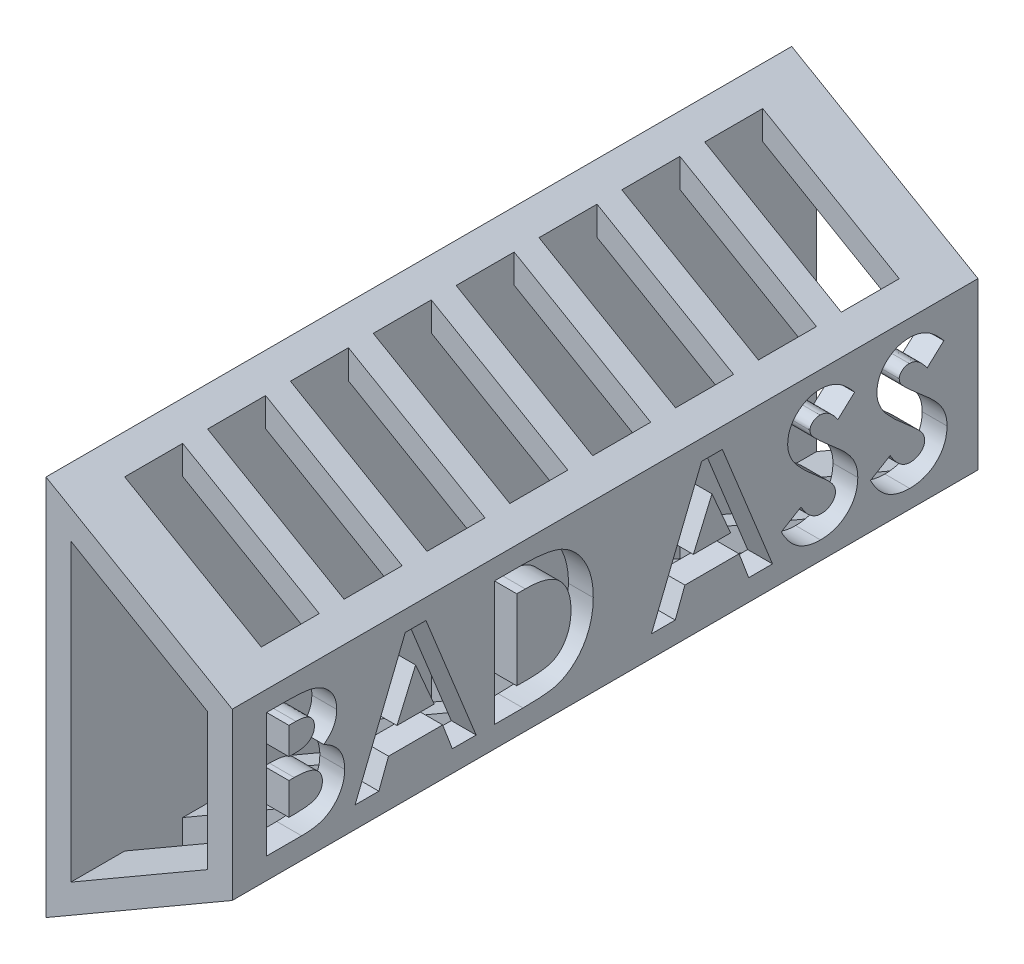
from build123d import *

# Parameters (mm, degrees)
BOSS_EXTRUDE1_DEPTH     = 457.2
CUT_EXTRUDE1_DEPTH      = 512.738034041
CUT_EXTRUDE1_DEPTH_BACK = 512.738034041
SKETCH2_W               = 83.713809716
SKETCH2_H               = 35.56
CUT_EXTRUDE2_DEPTH      = 15.24


with BuildPart() as part:
    # Sketch1 → Boss-Extrude1 (new body)
    with BuildSketch(Plane.XY):
        Polygon((-15.24, -26.443954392), (-15.24, 207.490045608), (98.953809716, 141.323045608), (98.953809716, 39.723045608), align=None)
        Polygon((0, 0), (0, 181.046091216), (83.713809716, 132.540032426), (83.713809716, 48.50605879), align=None, mode=Mode.SUBTRACT)
    extrude(amount=-BOSS_EXTRUDE1_DEPTH)

    # Sketch2 → Cut-Extrude1 (cut, two sides: drawn at the far end of the back side and taken through both)
    with BuildSketch(Plane(origin=(0, 0, 0), x_dir=(1, 0, 0), z_dir=(0, 1, 0)).offset(-CUT_EXTRUDE1_DEPTH_BACK)):
        with Locations((41.856904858, 406.4)):
            Rectangle(SKETCH2_W, SKETCH2_H)
        with Locations((41.856904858, 355.6)):
            Rectangle(SKETCH2_W, SKETCH2_H)
        with Locations((41.856904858, 101.6)):
            Rectangle(SKETCH2_W, SKETCH2_H)
        with Locations((41.856904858, 304.8)):
            Rectangle(SKETCH2_W, SKETCH2_H)
        with Locations((41.856904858, 254)):
            Rectangle(SKETCH2_W, SKETCH2_H)
        with Locations((41.856904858, 203.2)):
            Rectangle(SKETCH2_W, SKETCH2_H)
        with Locations((41.856904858, 50.8)):
            Rectangle(SKETCH2_W, SKETCH2_H)
        with Locations((41.856904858, 152.4)):
            Rectangle(SKETCH2_W, SKETCH2_H)
    extrude(amount=CUT_EXTRUDE1_DEPTH + CUT_EXTRUDE1_DEPTH_BACK, mode=Mode.SUBTRACT)

    # Sketch3 → Cut-Extrude2 (cut)
    # profile 1 of 6: a face of its own
    with BuildSketch(Plane(origin=(98.953809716, 0, 0), x_dir=(0, 0, -1), z_dir=(1, 0, 0))):
        with BuildLine():
            Line((21.060355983, 52.815741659), (21.060355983, 129.015741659))
            Line((21.060355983, 129.015741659), (33.271894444, 129.015741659))
            add(Edge.make_bspline(
                [(33.271894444, 129.015741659), (34.126778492, 129.015839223), (35.780962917, 129.016028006), (38.167519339, 128.93221998), (40.38084887, 128.823804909), (42.413907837, 128.702513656), (44.270156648, 128.493504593), (45.946772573, 128.273231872), (47.447105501, 128.007596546), (48.374679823, 127.769313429), (48.811077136, 127.657208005)],
                knots=[0, 0, 0, 0, 1.311965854, 2.538629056, 3.664479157, 4.713267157, 5.663616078, 6.530575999, 7.308677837, 8, 8, 8, 8], degree=3))
            add(Edge.make_bspline(
                [(48.811077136, 127.657208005), (49.384111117, 127.499081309), (50.508587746, 127.188785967), (52.119197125, 126.562131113), (53.647084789, 125.865559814), (55.090385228, 125.070902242), (56.440236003, 124.168564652), (57.691507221, 123.151385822), (58.871185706, 122.060195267), (59.937383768, 120.864581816), (60.901051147, 119.60119473), (61.738305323, 118.27036505), (62.46577189, 116.892442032), (63.047935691, 115.450085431), (63.486585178, 113.949937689), (63.807411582, 112.398404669), (64.015350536, 110.790576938), (64.03499804, 109.696719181), (64.044971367, 109.141462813)],
                knots=[0, 0, 0, 0, 1.099996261, 2.158545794, 3.195537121, 4.207578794, 5.205712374, 6.197378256, 7.190519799, 8.17788031, 9.159561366, 10.129234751, 11.085776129, 12.040971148, 13.00380137, 13.975669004, 14.972423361, 16, 16, 16, 16], degree=3))
            add(Edge.make_bspline(
                [(64.044971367, 109.141462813), (64.018894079, 108.428104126), (63.967564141, 107.023945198), (63.639664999, 104.961489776), (63.024803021, 103.012172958), (62.220271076, 101.140069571), (61.126359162, 99.352162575), (59.737302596, 97.649302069), (58.075599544, 95.979054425), (56.800981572, 94.977853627), (56.138000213, 94.457087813)],
                knots=[0, 0, 0, 0, 0.986156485, 1.941127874, 2.875419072, 3.804401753, 4.751181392, 5.761612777, 6.835722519, 8, 8, 8, 8], degree=3))
            add(Edge.make_bspline(
                [(56.138000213, 94.457087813), (56.675248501, 94.182827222), (57.728643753, 93.64507808), (59.224155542, 92.761179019), (60.608836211, 91.821040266), (61.888894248, 90.843577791), (63.03747897, 89.787355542), (64.10201737, 88.713234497), (65.029990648, 87.559671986), (65.859812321, 86.367783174), (66.581079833, 85.120309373), (67.2092243, 83.819357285), (67.7397954, 82.460482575), (68.189096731, 81.050600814), (68.524185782, 79.584862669), (68.74267097, 78.062743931), (68.909956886, 76.489435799), (68.922970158, 75.417737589), (68.929586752, 74.872833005)],
                knots=[0, 0, 0, 0, 1.164658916, 2.283573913, 3.35186032, 4.395461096, 5.390182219, 6.362969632, 7.312859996, 8.245001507, 9.165155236, 10.092416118, 11.032087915, 11.979892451, 12.947605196, 13.931445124, 14.948243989, 16, 16, 16, 16], degree=3))
            add(Edge.make_bspline(
                [(68.929586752, 74.872833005), (68.886649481, 73.832096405), (68.801912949, 71.778206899), (68.182360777, 68.762625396), (67.108254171, 65.903580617), (65.665950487, 63.212435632), (63.888754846, 60.767094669), (61.845489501, 58.624997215), (59.556725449, 56.811759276), (57.445063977, 55.587964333), (55.618643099, 54.766683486), (54.105852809, 54.258915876), (52.481148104, 53.788520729), (50.714768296, 53.458199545), (48.838735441, 53.155853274), (46.834758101, 52.969178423), (44.706581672, 52.842673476), (43.244858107, 52.824900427), (42.491605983, 52.815741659)],
                knots=[0, 0, 0, 0, 1.284142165, 2.534249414, 3.780121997, 5.041676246, 6.291546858, 7.49970053, 8.684500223, 9.883330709, 10.50184324, 11.153274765, 11.851151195, 12.587658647, 13.369265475, 14.195992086, 15.070362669, 16, 16, 16, 16], degree=3))
            Line((42.491605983, 52.815741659), (21.060355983, 52.815741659))
        make_face()
        with BuildLine():
            Line((34.73727906, 115.338818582), (34.73727906, 98.731126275))
            Line((34.73727906, 98.731126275), (38.370211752, 98.731126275))
            add(Edge.make_bspline(
                [(38.370211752, 98.731126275), (38.863959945, 98.735431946), (39.81711095, 98.743743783), (41.193836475, 98.850797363), (42.473968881, 99.03343742), (43.6526529, 99.288266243), (44.740868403, 99.611861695), (45.731663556, 100.001216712), (46.620682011, 100.476272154), (47.653515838, 101.183888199), (48.745295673, 102.22517689), (49.706377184, 103.729534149), (50.272447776, 105.459539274), (50.335492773, 106.679672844), (50.36804829, 107.309732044)],
                knots=[0, 0, 0, 0, 1.065314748, 2.056525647, 2.977365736, 3.853934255, 4.656397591, 5.425096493, 6.14721249, 6.826394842, 8.123232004, 9.372140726, 10.643011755, 12, 12, 12, 12], degree=3))
            add(Edge.make_bspline(
                [(50.36804829, 107.309732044), (50.341997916, 107.899887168), (50.291630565, 109.040928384), (49.72167026, 110.643051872), (48.836409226, 112.062861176), (47.791234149, 113.034604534), (46.806998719, 113.698276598), (45.964235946, 114.135276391), (45.039240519, 114.526474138), (44.014105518, 114.82559347), (42.894685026, 115.050042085), (41.686416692, 115.214872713), (40.387215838, 115.327063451), (39.489855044, 115.334816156), (39.026581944, 115.338818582)],
                knots=[0, 0, 0, 0, 1.347982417, 2.606269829, 3.849316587, 5.153353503, 5.842674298, 6.568177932, 7.326619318, 8.142485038, 9.012069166, 9.942760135, 10.937925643, 12, 12, 12, 12], degree=3))
            Line((39.026581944, 115.338818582), (34.73727906, 115.338818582))
        make_face(mode=Mode.SUBTRACT)
        with BuildLine():
            Line((34.73727906, 86.031126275), (34.73727906, 66.492664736))
            Line((34.73727906, 66.492664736), (38.675500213, 66.492664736))
            add(Edge.make_bspline(
                [(38.675500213, 66.492664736), (39.45409155, 66.497112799), (40.95103055, 66.505664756), (43.095393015, 66.608992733), (45.045154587, 66.795223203), (46.795149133, 67.027716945), (48.348057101, 67.342709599), (49.69862929, 67.743182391), (50.865387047, 68.183772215), (51.841334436, 68.727952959), (52.638627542, 69.361244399), (53.358100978, 70.008483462), (53.944714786, 70.755134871), (54.408854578, 71.56914695), (54.810566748, 72.43029905), (55.052851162, 73.372218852), (55.237318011, 74.366990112), (55.247469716, 75.055051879), (55.252663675, 75.407087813)],
                knots=[0, 0, 0, 0, 1.753078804, 3.370512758, 4.83203934, 6.162291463, 7.344201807, 8.395507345, 9.331626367, 10.147333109, 10.898971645, 11.62040215, 12.321813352, 13.025280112, 13.727906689, 14.453419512, 15.208716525, 16, 16, 16, 16], degree=3))
            add(Edge.make_bspline(
                [(55.252663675, 75.407087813), (55.241209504, 75.80964644), (55.218899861, 76.593722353), (55.036696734, 77.739732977), (54.705574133, 78.809609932), (54.288509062, 79.830711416), (53.708140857, 80.766478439), (53.018393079, 81.649294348), (52.18500168, 82.449264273), (51.247804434, 83.214773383), (50.154656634, 83.885018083), (48.905045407, 84.46657408), (47.492182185, 84.952268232), (45.911690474, 85.338978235), (44.170499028, 85.667173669), (42.255899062, 85.863142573), (40.183836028, 86.00889326), (38.7470338, 86.023546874), (38.003865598, 86.031126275)],
                knots=[0, 0, 0, 0, 0.845221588, 1.646264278, 2.427170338, 3.19324141, 3.95557735, 4.731569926, 5.540061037, 6.376114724, 7.268642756, 8.224665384, 9.265483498, 10.400594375, 11.639216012, 12.983232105, 14.439614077, 16, 16, 16, 16], degree=3))
            Line((38.003865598, 86.031126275), (34.73727906, 86.031126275))
        make_face(mode=Mode.SUBTRACT)
    # profile 2 of 6: a face of its own
    with BuildSketch(Plane(origin=(98.953809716, 0, 0), x_dir=(0, 0, -1), z_dir=(1, 0, 0))):
        Polygon((106.067928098, 129.015741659), (118.752663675, 129.015741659), (149.525740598, 52.815741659), (134.917687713, 52.815741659), (128.99509156, 68.44651089), (95.794971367, 68.44651089), (89.872375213, 52.815741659), (75.279586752, 52.815741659), align=None)
        Polygon((112.402663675, 108.576679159), (100.984875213, 82.123433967), (123.820452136, 82.123433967), align=None, mode=Mode.SUBTRACT)
    # profile 3 of 6: a face of its own
    with BuildSketch(Plane(origin=(98.953809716, 0, 0), x_dir=(0, 0, -1), z_dir=(1, 0, 0))):
        with BuildLine():
            Line((160.760355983, 129.015741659), (177.993889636, 129.015741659))
            add(Edge.make_bspline(
                [(177.993889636, 129.015741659), (179.337441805, 129.00634977), (181.934543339, 128.988195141), (185.697229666, 128.783636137), (189.196049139, 128.46903891), (192.433257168, 128.036253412), (195.402216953, 127.463559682), (198.099100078, 126.745227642), (200.532957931, 125.916032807), (202.73047726, 124.940316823), (204.736601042, 123.802728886), (206.6414796, 122.535547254), (208.441372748, 121.092351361), (210.161539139, 119.500983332), (211.779779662, 117.732329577), (213.323043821, 115.815685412), (214.753545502, 113.723256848), (216.114525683, 111.505213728), (217.345351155, 109.152156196), (218.418923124, 106.684112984), (219.318260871, 104.116966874), (220.049019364, 101.447981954), (220.631518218, 98.686018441), (221.039080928, 95.825502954), (221.291040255, 92.869083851), (221.316599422, 90.865373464), (221.329586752, 89.847232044)],
                knots=[0, 0, 0, 0, 1.44355588, 2.790409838, 4.047694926, 5.217575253, 6.298404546, 7.294384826, 8.214239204, 9.058592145, 9.873746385, 10.689560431, 11.514393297, 12.350027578, 13.205127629, 14.088021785, 14.991911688, 15.926770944, 16.882954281, 17.842803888, 18.816321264, 19.80318086, 20.814351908, 21.847355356, 22.906180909, 24, 24, 24, 24], degree=3))
            add(Edge.make_bspline(
                [(221.329586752, 89.847232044), (221.295578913, 88.410568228), (221.22863249, 85.58241141), (220.664713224, 81.432123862), (219.752664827, 77.453659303), (218.470241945, 73.678138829), (216.880380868, 70.139184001), (214.98111378, 66.899202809), (212.800288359, 63.975585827), (210.363311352, 61.382890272), (207.724658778, 59.154433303), (204.982566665, 57.245922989), (202.11032204, 55.740903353), (199.579473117, 54.786495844), (197.384911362, 54.192936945), (195.458109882, 53.842137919), (193.269459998, 53.520434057), (190.798554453, 53.271828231), (188.056232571, 53.05013293), (185.031563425, 52.929672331), (181.734340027, 52.829587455), (179.444106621, 52.820477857), (178.253384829, 52.815741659)],
                knots=[0, 0, 0, 0, 1.315458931, 2.589557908, 3.828601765, 5.048913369, 6.235739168, 7.376350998, 8.481830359, 9.569842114, 10.627874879, 11.640079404, 12.624025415, 13.590060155, 14.111227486, 14.704434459, 15.382649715, 16.137166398, 16.978595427, 17.902333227, 18.909396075, 20, 20, 20, 20], degree=3))
            Line((178.253384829, 52.815741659), (160.760355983, 52.815741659))
            Line((160.760355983, 52.815741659), (160.760355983, 129.015741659))
        make_face()
        with BuildLine():
            Line((174.43727906, 115.338818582), (174.43727906, 66.492664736))
            Line((174.43727906, 66.492664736), (181.58102906, 66.492664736))
            add(Edge.make_bspline(
                [(181.58102906, 66.492664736), (182.431025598, 66.494222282), (184.065851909, 66.497217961), (186.42617104, 66.639904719), (188.608867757, 66.783122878), (190.607933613, 67.054955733), (192.437917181, 67.357758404), (194.073679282, 67.779149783), (195.54894008, 68.221785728), (196.845679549, 68.78531615), (198.033387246, 69.419607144), (199.13306891, 70.162752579), (200.194569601, 70.987987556), (201.198043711, 71.919583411), (202.147289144, 72.945204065), (203.036689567, 74.070134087), (203.878116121, 75.29094128), (204.649970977, 76.614080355), (205.355296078, 78.025578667), (205.980998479, 79.511763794), (206.499798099, 81.085012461), (206.930992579, 82.730597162), (207.239129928, 84.462844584), (207.494054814, 86.26892421), (207.62547602, 88.155991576), (207.643512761, 89.44001528), (207.652663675, 90.091462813)],
                knots=[0, 0, 0, 0, 1.50275155, 2.890291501, 4.180787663, 5.369391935, 6.45668281, 7.458360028, 8.354766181, 9.177074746, 9.954075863, 10.732690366, 11.5210699, 12.329727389, 13.151100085, 13.990027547, 14.863562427, 15.770965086, 16.696477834, 17.652329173, 18.619756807, 19.62365428, 20.657822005, 21.729286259, 22.847956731, 24, 24, 24, 24], degree=3))
            add(Edge.make_bspline(
                [(207.652663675, 90.091462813), (207.634438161, 91.089744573), (207.59889982, 93.036316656), (207.256175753, 95.871541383), (206.698286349, 98.5413302), (205.902231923, 101.035774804), (204.898780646, 103.361885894), (203.642727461, 105.49995638), (202.188128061, 107.485902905), (201.037870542, 108.650922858), (200.463120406, 109.233049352)],
                knots=[0, 0, 0, 0, 1.13821349, 2.219428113, 3.251817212, 4.244760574, 5.201143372, 6.134805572, 7.068016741, 8, 8, 8, 8], degree=3))
            add(Edge.make_bspline(
                [(200.463120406, 109.233049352), (199.89636235, 109.729099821), (198.738823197, 110.742226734), (196.706564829, 111.956211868), (194.467121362, 113.022816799), (191.969261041, 113.86851556), (189.237124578, 114.537330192), (186.254439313, 114.99859529), (183.037178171, 115.294999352), (180.808334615, 115.323899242), (179.657711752, 115.338818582)],
                knots=[0, 0, 0, 0, 0.813307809, 1.661089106, 2.549956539, 3.493439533, 4.508053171, 5.589449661, 6.755572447, 8, 8, 8, 8], degree=3))
            Line((179.657711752, 115.338818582), (174.43727906, 115.338818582))
        make_face(mode=Mode.SUBTRACT)
    # profile 4 of 6: a face of its own
    with BuildSketch(Plane(origin=(98.953809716, 0, 0), x_dir=(0, 0, -1), z_dir=(1, 0, 0))):
        Polygon((287.775620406, 129.015741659), (300.460355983, 129.015741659), (331.233432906, 52.815741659), (316.625380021, 52.815741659), (310.702783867, 68.44651089), (277.502663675, 68.44651089), (271.580067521, 52.815741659), (256.98727906, 52.815741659), align=None)
        Polygon((294.110355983, 108.576679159), (282.692567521, 82.123433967), (305.528144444, 82.123433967), align=None, mode=Mode.SUBTRACT)
    # profile 5 of 6: a face of its own
    with BuildSketch(Plane(origin=(98.953809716, 0, 0), x_dir=(0, 0, -1), z_dir=(1, 0, 0))):
        with BuildLine():
            Line((381.544971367, 118.834371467), (371.317807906, 109.477280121))
            add(Edge.make_bspline(
                [(371.317807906, 109.477280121), (370.879720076, 110.095248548), (370.038652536, 111.281661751), (368.675369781, 112.870296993), (367.318242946, 114.225521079), (365.954699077, 115.341672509), (364.572652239, 116.211969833), (363.174501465, 116.828149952), (361.768173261, 117.219861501), (360.823337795, 117.268639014), (360.357952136, 117.292664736)],
                knots=[0, 0, 0, 0, 1.299362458, 2.494594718, 3.587462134, 4.587049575, 5.512617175, 6.380583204, 7.202344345, 8, 8, 8, 8], degree=3))
            add(Edge.make_bspline(
                [(360.357952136, 117.292664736), (359.923853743, 117.277440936), (359.085723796, 117.248047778), (357.890907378, 116.95588198), (356.830132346, 116.451646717), (355.90443397, 115.792316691), (355.171144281, 114.997976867), (354.585669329, 114.164918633), (354.255997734, 113.245410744), (354.212606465, 112.613855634), (354.191125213, 112.30119839)],
                knots=[0, 0, 0, 0, 1.185010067, 2.2879431, 3.333075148, 4.379039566, 5.372662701, 6.27520591, 7.14612461, 8, 8, 8, 8], degree=3))
            add(Edge.make_bspline(
                [(354.191125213, 112.30119839), (354.204586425, 111.98403249), (354.231695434, 111.345304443), (354.493531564, 110.409168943), (354.888193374, 109.494455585), (355.265308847, 108.937626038), (355.458072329, 108.653001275)],
                knots=[0, 0, 0, 0, 0.967525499, 1.948461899, 2.951351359, 4, 4, 4, 4], degree=3))
            add(Edge.make_bspline(
                [(355.458072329, 108.653001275), (355.633315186, 108.431765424), (356.0367011, 107.922509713), (356.80587542, 107.115928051), (357.771796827, 106.127794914), (358.971636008, 104.992089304), (360.355584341, 103.667966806), (361.987789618, 102.20747918), (363.821269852, 100.565396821), (365.124465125, 99.42191013), (365.807351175, 98.822712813)],
                knots=[0, 0, 0, 0, 0.473873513, 1.090794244, 1.870441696, 2.795289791, 3.865433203, 5.087734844, 6.473946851, 8, 8, 8, 8], degree=3))
            add(Edge.make_bspline(
                [(365.807351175, 98.822712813), (366.448337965, 98.267971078), (367.664797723, 97.215186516), (369.395578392, 95.720927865), (370.916646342, 94.376579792), (372.250160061, 93.202318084), (373.375904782, 92.185822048), (374.298613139, 91.322232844), (375.029554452, 90.628362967), (375.445051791, 90.209265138), (375.622375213, 90.030405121)],
                knots=[0, 0, 0, 0, 1.543621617, 2.929473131, 4.163658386, 5.240097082, 6.164993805, 6.925417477, 7.541396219, 8, 8, 8, 8], degree=3))
            add(Edge.make_bspline(
                [(375.622375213, 90.030405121), (376.29510331, 89.302369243), (377.588322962, 87.902828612), (379.269052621, 85.73398078), (380.652347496, 83.616743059), (381.722490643, 81.511276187), (382.530705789, 79.387202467), (383.100508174, 77.192429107), (383.441766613, 74.904022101), (383.479654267, 73.342463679), (383.498817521, 72.552640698)],
                knots=[0, 0, 0, 0, 1.206664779, 2.319633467, 3.337109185, 4.282041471, 5.190008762, 6.099243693, 7.03861361, 8, 8, 8, 8], degree=3))
            add(Edge.make_bspline(
                [(383.498817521, 72.552640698), (383.485177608, 71.783055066), (383.45841559, 70.273099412), (383.130632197, 68.06350423), (382.663232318, 65.948825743), (381.940550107, 63.952074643), (381.059749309, 62.040474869), (379.955538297, 60.243803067), (378.658793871, 58.543876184), (377.172525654, 56.971082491), (375.52853652, 55.54388123), (373.765201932, 54.273352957), (371.865279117, 53.224370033), (369.845000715, 52.360607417), (367.705448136, 51.695325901), (365.449170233, 51.203620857), (363.072715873, 50.908507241), (361.447662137, 50.877656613), (360.617447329, 50.861895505)],
                knots=[0, 0, 0, 0, 1.043214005, 2.046824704, 3.02475056, 3.976699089, 4.921714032, 5.875962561, 6.831408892, 7.817874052, 8.806269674, 9.781291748, 10.760897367, 11.74438705, 12.757449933, 13.795994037, 14.874007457, 16, 16, 16, 16], degree=3))
            add(Edge.make_bspline(
                [(360.617447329, 50.861895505), (359.965735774, 50.873457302), (358.674973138, 50.896356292), (356.772584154, 51.083307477), (354.935612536, 51.385026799), (353.16612747, 51.81748072), (351.456157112, 52.36545849), (349.805631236, 53.034792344), (348.225943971, 53.835856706), (346.705142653, 54.752178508), (345.250620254, 55.816148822), (343.843984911, 57.006015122), (342.499208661, 58.340078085), (341.209832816, 59.815182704), (339.984107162, 61.43550612), (338.781909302, 63.178482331), (337.656668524, 65.076458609), (336.961557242, 66.407904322), (336.606509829, 67.087977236)],
                knots=[0, 0, 0, 0, 1.016823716, 2.013894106, 2.979844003, 3.91962641, 4.853723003, 5.779685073, 6.695824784, 7.614987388, 8.547259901, 9.504950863, 10.487499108, 11.500346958, 12.559593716, 13.656357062, 14.802919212, 16, 16, 16, 16], degree=3))
            Line((336.606509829, 67.087977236), (348.634875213, 74.308049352))
            add(Edge.make_bspline(
                [(348.634875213, 74.308049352), (349.078986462, 73.536077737), (349.930385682, 72.056142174), (351.373161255, 70.067661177), (352.851211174, 68.364856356), (354.398706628, 66.977824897), (355.996830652, 65.888020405), (357.653302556, 65.10917051), (359.369286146, 64.627063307), (360.538136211, 64.568186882), (361.12117329, 64.538818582)],
                knots=[0, 0, 0, 0, 1.283663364, 2.460892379, 3.537111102, 4.529833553, 5.449777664, 6.316464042, 7.160231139, 8, 8, 8, 8], degree=3))
            add(Edge.make_bspline(
                [(361.12117329, 64.538818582), (361.714205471, 64.562802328), (362.864774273, 64.609334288), (364.507064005, 65.039135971), (366.012777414, 65.713956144), (367.314304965, 66.676831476), (368.416356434, 67.788135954), (369.229733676, 69.024513), (369.740702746, 70.362243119), (369.794724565, 71.291518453), (369.821894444, 71.758890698)],
                knots=[0, 0, 0, 0, 1.13588714, 2.203786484, 3.234766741, 4.283437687, 5.291419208, 6.222934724, 7.106237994, 8, 8, 8, 8], degree=3))
            add(Edge.make_bspline(
                [(369.821894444, 71.758890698), (369.796804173, 72.193704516), (369.745835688, 73.076987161), (369.370417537, 74.390286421), (368.78352446, 75.702988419), (368.089188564, 76.779702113), (367.382614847, 77.681205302), (366.706971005, 78.462317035), (365.884215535, 79.325308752), (364.916434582, 80.271266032), (363.816415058, 81.308516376), (362.583230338, 82.436958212), (361.202759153, 83.646651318), (360.227039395, 84.47068231), (359.716846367, 84.901558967)],
                knots=[0, 0, 0, 0, 0.916159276, 1.861089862, 2.860218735, 3.940849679, 4.552606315, 5.27541173, 6.11797699, 7.06649574, 8.129236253, 9.306560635, 10.591630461, 12, 12, 12, 12], degree=3))
            add(Edge.make_bspline(
                [(359.716846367, 84.901558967), (358.746949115, 85.722185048), (356.885422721, 87.297214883), (354.254849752, 89.623484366), (351.884467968, 91.797596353), (349.794750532, 93.846427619), (347.959071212, 95.732141), (346.389862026, 97.47005298), (345.104361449, 99.073569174), (343.751649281, 100.972826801), (342.466302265, 103.28720272), (341.355397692, 106.071665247), (340.634689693, 108.855774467), (340.553944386, 110.724872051), (340.514202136, 111.644828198)],
                knots=[0, 0, 0, 0, 1.345494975, 2.582412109, 3.71882943, 4.751509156, 5.681369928, 6.505683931, 7.230279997, 7.856715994, 8.973648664, 10.023341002, 11.027102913, 12, 12, 12, 12], degree=3))
            add(Edge.make_bspline(
                [(340.514202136, 111.644828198), (340.530730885, 112.297211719), (340.563294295, 113.582477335), (340.853764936, 115.472273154), (341.287884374, 117.295767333), (341.918350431, 119.046306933), (342.736619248, 120.721699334), (343.730374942, 122.330146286), (344.915048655, 123.856844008), (346.250095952, 125.300780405), (347.720976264, 126.620373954), (349.292798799, 127.785047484), (350.956666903, 128.768747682), (352.702401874, 129.584798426), (354.540821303, 130.20943343), (356.458381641, 130.652205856), (358.457833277, 130.915552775), (359.81781712, 130.951351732), (360.510596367, 130.969587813)],
                knots=[0, 0, 0, 0, 1.010766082, 1.991317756, 2.957454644, 3.913069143, 4.869106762, 5.843196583, 6.838735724, 7.860187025, 8.887984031, 9.89767229, 10.887916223, 11.879572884, 12.879850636, 13.892031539, 14.926195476, 16, 16, 16, 16], degree=3))
            add(Edge.make_bspline(
                [(360.510596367, 130.969587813), (361.408403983, 130.936744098), (363.196932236, 130.871315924), (365.841322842, 130.359688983), (368.424253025, 129.555101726), (370.505626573, 128.584455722), (372.161736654, 127.644190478), (373.43099033, 126.778512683), (374.722524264, 125.786832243), (376.046753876, 124.66602411), (377.379072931, 123.394970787), (378.75736563, 122.003930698), (380.16285105, 120.480882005), (381.076193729, 119.392823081), (381.544971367, 118.834371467)],
                knots=[0, 0, 0, 0, 1.282922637, 2.555718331, 3.837320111, 5.142675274, 5.830281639, 6.55870424, 7.337177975, 8.157850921, 9.037902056, 9.96903443, 10.957596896, 12, 12, 12, 12], degree=3))
        make_face()
    # profile 6 of 6: a face of its own
    with BuildSketch(Plane(origin=(98.953809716, 0, 0), x_dir=(0, 0, -1), z_dir=(1, 0, 0))):
        with BuildLine():
            Line((436.252663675, 118.834371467), (426.025500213, 109.477280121))
            add(Edge.make_bspline(
                [(426.025500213, 109.477280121), (425.587412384, 110.095248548), (424.746344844, 111.281661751), (423.383062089, 112.870296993), (422.025935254, 114.225521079), (420.662391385, 115.341672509), (419.280344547, 116.211969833), (417.882193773, 116.828149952), (416.475865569, 117.219861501), (415.531030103, 117.268639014), (415.065644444, 117.292664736)],
                knots=[0, 0, 0, 0, 1.299362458, 2.494594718, 3.587462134, 4.587049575, 5.512617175, 6.380583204, 7.202344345, 8, 8, 8, 8], degree=3))
            add(Edge.make_bspline(
                [(415.065644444, 117.292664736), (414.631546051, 117.277440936), (413.793416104, 117.248047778), (412.598599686, 116.95588198), (411.537824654, 116.451646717), (410.612126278, 115.792316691), (409.878836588, 114.997976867), (409.293361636, 114.164918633), (408.963690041, 113.245410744), (408.920298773, 112.613855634), (408.898817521, 112.30119839)],
                knots=[0, 0, 0, 0, 1.185010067, 2.2879431, 3.333075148, 4.379039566, 5.372662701, 6.27520591, 7.14612461, 8, 8, 8, 8], degree=3))
            add(Edge.make_bspline(
                [(408.898817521, 112.30119839), (408.912278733, 111.98403249), (408.939387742, 111.345304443), (409.201223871, 110.409168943), (409.595885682, 109.494455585), (409.973001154, 108.937626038), (410.165764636, 108.653001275)],
                knots=[0, 0, 0, 0, 0.967525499, 1.948461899, 2.951351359, 4, 4, 4, 4], degree=3))
            add(Edge.make_bspline(
                [(410.165764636, 108.653001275), (410.341007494, 108.431765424), (410.744393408, 107.922509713), (411.513567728, 107.115928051), (412.479489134, 106.127794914), (413.679328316, 104.992089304), (415.063276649, 103.667966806), (416.695481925, 102.20747918), (418.52896216, 100.565396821), (419.832157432, 99.42191013), (420.515043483, 98.822712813)],
                knots=[0, 0, 0, 0, 0.473873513, 1.090794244, 1.870441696, 2.795289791, 3.865433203, 5.087734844, 6.473946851, 8, 8, 8, 8], degree=3))
            add(Edge.make_bspline(
                [(420.515043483, 98.822712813), (421.156030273, 98.267971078), (422.372490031, 97.215186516), (424.1032707, 95.720927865), (425.624338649, 94.376579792), (426.957852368, 93.202318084), (428.083597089, 92.185822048), (429.006305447, 91.322232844), (429.73724676, 90.628362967), (430.152744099, 90.209265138), (430.330067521, 90.030405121)],
                knots=[0, 0, 0, 0, 1.543621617, 2.929473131, 4.163658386, 5.240097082, 6.164993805, 6.925417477, 7.541396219, 8, 8, 8, 8], degree=3))
            add(Edge.make_bspline(
                [(430.330067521, 90.030405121), (431.002795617, 89.302369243), (432.29601527, 87.902828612), (433.976744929, 85.73398078), (435.360039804, 83.616743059), (436.430182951, 81.511276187), (437.238398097, 79.387202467), (437.808200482, 77.192429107), (438.149458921, 74.904022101), (438.187346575, 73.342463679), (438.206509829, 72.552640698)],
                knots=[0, 0, 0, 0, 1.206664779, 2.319633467, 3.337109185, 4.282041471, 5.190008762, 6.099243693, 7.03861361, 8, 8, 8, 8], degree=3))
            add(Edge.make_bspline(
                [(438.206509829, 72.552640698), (438.192869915, 71.783055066), (438.166107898, 70.273099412), (437.838324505, 68.06350423), (437.370924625, 65.948825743), (436.648242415, 63.952074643), (435.767441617, 62.040474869), (434.663230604, 60.243803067), (433.366486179, 58.543876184), (431.880217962, 56.971082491), (430.236228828, 55.54388123), (428.47289424, 54.273352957), (426.572971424, 53.224370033), (424.552693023, 52.360607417), (422.413140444, 51.695325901), (420.15686254, 51.203620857), (417.780408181, 50.908507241), (416.155354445, 50.877656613), (415.325139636, 50.861895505)],
                knots=[0, 0, 0, 0, 1.043214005, 2.046824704, 3.02475056, 3.976699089, 4.921714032, 5.875962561, 6.831408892, 7.817874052, 8.806269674, 9.781291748, 10.760897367, 11.74438705, 12.757449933, 13.795994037, 14.874007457, 16, 16, 16, 16], degree=3))
            add(Edge.make_bspline(
                [(415.325139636, 50.861895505), (414.673428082, 50.873457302), (413.382665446, 50.896356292), (411.480276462, 51.083307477), (409.643304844, 51.385026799), (407.873819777, 51.81748072), (406.163849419, 52.36545849), (404.513323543, 53.034792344), (402.933636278, 53.835856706), (401.412834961, 54.752178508), (399.958312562, 55.816148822), (398.551677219, 57.006015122), (397.206900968, 58.340078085), (395.917525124, 59.815182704), (394.69179947, 61.43550612), (393.489601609, 63.178482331), (392.364360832, 65.076458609), (391.669249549, 66.407904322), (391.314202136, 67.087977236)],
                knots=[0, 0, 0, 0, 1.016823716, 2.013894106, 2.979844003, 3.91962641, 4.853723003, 5.779685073, 6.695824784, 7.614987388, 8.547259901, 9.504950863, 10.487499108, 11.500346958, 12.559593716, 13.656357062, 14.802919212, 16, 16, 16, 16], degree=3))
            Line((391.314202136, 67.087977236), (403.342567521, 74.308049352))
            add(Edge.make_bspline(
                [(403.342567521, 74.308049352), (403.78667877, 73.536077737), (404.63807799, 72.056142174), (406.080853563, 70.067661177), (407.558903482, 68.364856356), (409.106398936, 66.977824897), (410.70452296, 65.888020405), (412.360994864, 65.10917051), (414.076978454, 64.627063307), (415.245828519, 64.568186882), (415.828865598, 64.538818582)],
                knots=[0, 0, 0, 0, 1.283663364, 2.460892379, 3.537111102, 4.529833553, 5.449777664, 6.316464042, 7.160231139, 8, 8, 8, 8], degree=3))
            add(Edge.make_bspline(
                [(415.828865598, 64.538818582), (416.421897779, 64.562802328), (417.572466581, 64.609334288), (419.214756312, 65.039135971), (420.720469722, 65.713956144), (422.021997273, 66.676831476), (423.124048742, 67.788135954), (423.937425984, 69.024513), (424.448395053, 70.362243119), (424.502416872, 71.291518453), (424.529586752, 71.758890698)],
                knots=[0, 0, 0, 0, 1.13588714, 2.203786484, 3.234766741, 4.283437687, 5.291419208, 6.222934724, 7.106237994, 8, 8, 8, 8], degree=3))
            add(Edge.make_bspline(
                [(424.529586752, 71.758890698), (424.50449648, 72.193704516), (424.453527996, 73.076987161), (424.078109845, 74.390286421), (423.491216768, 75.702988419), (422.796880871, 76.779702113), (422.090307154, 77.681205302), (421.414663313, 78.462317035), (420.591907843, 79.325308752), (419.62412689, 80.271266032), (418.524107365, 81.308516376), (417.290922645, 82.436958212), (415.91045146, 83.646651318), (414.934731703, 84.47068231), (414.424538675, 84.901558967)],
                knots=[0, 0, 0, 0, 0.916159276, 1.861089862, 2.860218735, 3.940849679, 4.552606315, 5.27541173, 6.11797699, 7.06649574, 8.129236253, 9.306560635, 10.591630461, 12, 12, 12, 12], degree=3))
            add(Edge.make_bspline(
                [(414.424538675, 84.901558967), (413.454641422, 85.722185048), (411.593115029, 87.297214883), (408.962542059, 89.623484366), (406.592160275, 91.797596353), (404.50244284, 93.846427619), (402.66676352, 95.732141), (401.097554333, 97.47005298), (399.812053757, 99.073569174), (398.459341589, 100.972826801), (397.173994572, 103.28720272), (396.06309, 106.071665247), (395.342382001, 108.855774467), (395.261636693, 110.724872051), (395.221894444, 111.644828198)],
                knots=[0, 0, 0, 0, 1.345494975, 2.582412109, 3.71882943, 4.751509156, 5.681369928, 6.505683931, 7.230279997, 7.856715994, 8.973648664, 10.023341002, 11.027102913, 12, 12, 12, 12], degree=3))
            add(Edge.make_bspline(
                [(395.221894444, 111.644828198), (395.238423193, 112.297211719), (395.270986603, 113.582477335), (395.561457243, 115.472273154), (395.995576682, 117.295767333), (396.626042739, 119.046306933), (397.444311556, 120.721699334), (398.438067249, 122.330146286), (399.622740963, 123.856844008), (400.95778826, 125.300780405), (402.428668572, 126.620373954), (404.000491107, 127.785047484), (405.664359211, 128.768747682), (407.410094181, 129.584798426), (409.248513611, 130.20943343), (411.166073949, 130.652205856), (413.165525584, 130.915552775), (414.525509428, 130.951351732), (415.218288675, 130.969587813)],
                knots=[0, 0, 0, 0, 1.010766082, 1.991317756, 2.957454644, 3.913069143, 4.869106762, 5.843196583, 6.838735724, 7.860187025, 8.887984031, 9.89767229, 10.887916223, 11.879572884, 12.879850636, 13.892031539, 14.926195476, 16, 16, 16, 16], degree=3))
            add(Edge.make_bspline(
                [(415.218288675, 130.969587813), (416.116096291, 130.936744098), (417.904624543, 130.871315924), (420.549015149, 130.359688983), (423.131945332, 129.555101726), (425.213318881, 128.584455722), (426.869428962, 127.644190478), (428.138682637, 126.778512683), (429.430216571, 125.786832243), (430.754446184, 124.66602411), (432.086765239, 123.394970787), (433.465057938, 122.003930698), (434.870543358, 120.480882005), (435.783886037, 119.392823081), (436.252663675, 118.834371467)],
                knots=[0, 0, 0, 0, 1.282922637, 2.555718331, 3.837320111, 5.142675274, 5.830281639, 6.55870424, 7.337177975, 8.157850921, 9.037902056, 9.96903443, 10.957596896, 12, 12, 12, 12], degree=3))
        make_face()
    extrude(amount=-CUT_EXTRUDE2_DEPTH, mode=Mode.SUBTRACT)


with BuildPart() as cut_extrude2_piece_1:
    # of the separate pieces the step leaves, piece 1, a body of its own (cut_extrude2_pieces)
    add(part.part.solids().sort_by_distance((-15.24, -26.443954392, 0))[0])


with BuildPart() as cut_extrude2_piece_2:
    # of the separate pieces the step leaves, piece 2, a body of its own (cut_extrude2_pieces)
    add(part.part.solids().sort_by_distance((98.953809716, 115.338818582, -174.43727906))[0])


with BuildPart() as cut_extrude2_piece_3:
    # of the separate pieces the step leaves, piece 3, a body of its own (cut_extrude2_pieces)
    add(part.part.solids().sort_by_distance((98.953809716, 86.031126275, -34.73727906))[0])


with BuildPart() as cut_extrude2_piece_4:
    # of the separate pieces the step leaves, piece 4, a body of its own (cut_extrude2_pieces)
    add(part.part.solids().sort_by_distance((98.953809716, 108.576679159, -112.402663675))[0])


with BuildPart() as cut_extrude2_piece_5:
    # of the separate pieces the step leaves, piece 5, a body of its own (cut_extrude2_pieces)
    add(part.part.solids().sort_by_distance((98.953809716, 108.576679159, -294.110355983))[0])


with BuildPart() as cut_extrude2_piece_6:
    # of the separate pieces the step leaves, piece 6, a body of its own (cut_extrude2_pieces)
    add(part.part.solids().sort_by_distance((98.953809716, 115.338818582, -34.73727906))[0])


solid = Compound([cut_extrude2_piece_1.part, cut_extrude2_piece_2.part, cut_extrude2_piece_3.part, cut_extrude2_piece_4.part, cut_extrude2_piece_5.part, cut_extrude2_piece_6.part])
